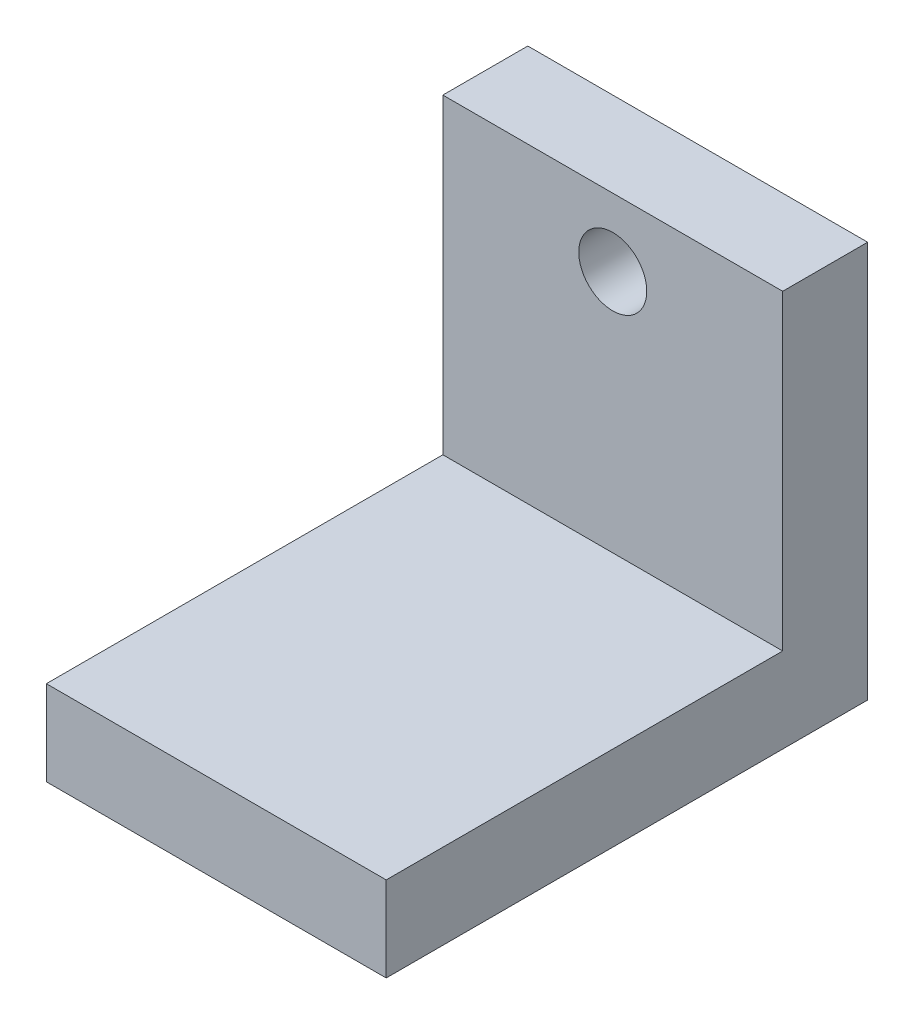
ISO-10303-21;
HEADER;
FILE_DESCRIPTION(('STEP AP214'),'2;1');
FILE_NAME('part.step','',(''),(''),'','','');
FILE_SCHEMA(('AUTOMOTIVE_DESIGN { 1 0 10303 214 1 1 1 1 }'));
ENDSEC;
DATA;
#1=APPLICATION_CONTEXT('core data for automotive mechanical design processes');
#2=APPLICATION_PROTOCOL_DEFINITION('international standard','automotive_design',2000,#1);
#3=PRODUCT_CONTEXT('',#1,'mechanical');
#4=PRODUCT('Part','Part','',(#3));
#5=PRODUCT_RELATED_PRODUCT_CATEGORY('part','',(#4));
#6=PRODUCT_DEFINITION_FORMATION('','',#4);
#7=PRODUCT_DEFINITION_CONTEXT('part definition',#1,'design');
#8=PRODUCT_DEFINITION('design','',#6,#7);
#9=PRODUCT_DEFINITION_SHAPE('','',#8);
#10=(LENGTH_UNIT() NAMED_UNIT(*) SI_UNIT(.MILLI.,.METRE.));
#11=(NAMED_UNIT(*) PLANE_ANGLE_UNIT() SI_UNIT($,.RADIAN.));
#12=(NAMED_UNIT(*) SI_UNIT($,.STERADIAN.) SOLID_ANGLE_UNIT());
#13=UNCERTAINTY_MEASURE_WITH_UNIT(LENGTH_MEASURE(1.E-05),#10,'distance_accuracy_value','');
#14=(GEOMETRIC_REPRESENTATION_CONTEXT(3) GLOBAL_UNCERTAINTY_ASSIGNED_CONTEXT((#13)) GLOBAL_UNIT_ASSIGNED_CONTEXT((#10,
#11,#12)) REPRESENTATION_CONTEXT('',''));
#15=CARTESIAN_POINT('',(0.,0.,0.));
#16=DIRECTION('',(0.,0.,1.));
#17=DIRECTION('',(1.,0.,0.));
#18=AXIS2_PLACEMENT_3D('',#15,#16,#17);
#19=CARTESIAN_POINT('',(30.,-3.75,-25.));
#20=DIRECTION('',(0.,0.,1.));
#21=DIRECTION('',(0.,-1.,0.));
#22=AXIS2_PLACEMENT_3D('',#19,#20,#21);
#23=PLANE('',#22);
#24=CARTESIAN_POINT('',(15.,25.25,-25.));
#25=DIRECTION('',(0.,0.,1.));
#26=DIRECTION('',(1.,0.,0.));
#27=AXIS2_PLACEMENT_3D('',#24,#25,#26);
#28=CIRCLE('',#27,3.);
#29=CARTESIAN_POINT('',(18.,25.25,-25.));
#30=VERTEX_POINT('',#29);
#31=EDGE_CURVE('E153',#30,#30,#28,.T.);
#32=ORIENTED_EDGE('',*,*,#31,.T.);
#33=EDGE_LOOP('',(#32));
#34=FACE_BOUND('',#33,.T.);
#35=DIRECTION('',(0.,1.,0.));
#36=VECTOR('',#35,1.);
#37=CARTESIAN_POINT('',(0.,-3.75,-25.));
#38=LINE('',#37,#36);
#39=CARTESIAN_POINT('',(0.,-3.75,-25.));
#40=VERTEX_POINT('',#39);
#41=CARTESIAN_POINT('',(0.,31.25,-25.));
#42=VERTEX_POINT('',#41);
#43=EDGE_CURVE('E128',#40,#42,#38,.T.);
#44=ORIENTED_EDGE('',*,*,#43,.T.);
#45=DIRECTION('',(-1.,0.,0.));
#46=VECTOR('',#45,1.);
#47=CARTESIAN_POINT('',(30.,31.25,-25.));
#48=LINE('',#47,#46);
#49=CARTESIAN_POINT('',(30.,31.25,-25.));
#50=VERTEX_POINT('',#49);
#51=EDGE_CURVE('E48',#50,#42,#48,.T.);
#52=ORIENTED_EDGE('',*,*,#51,.F.);
#53=DIRECTION('',(0.,1.,0.));
#54=VECTOR('',#53,1.);
#55=CARTESIAN_POINT('',(30.,-3.75,-25.));
#56=LINE('',#55,#54);
#57=CARTESIAN_POINT('',(30.,-3.75,-25.));
#58=VERTEX_POINT('',#57);
#59=EDGE_CURVE('E94',#58,#50,#56,.T.);
#60=ORIENTED_EDGE('',*,*,#59,.F.);
#61=DIRECTION('',(-1.,0.,0.));
#62=VECTOR('',#61,1.);
#63=CARTESIAN_POINT('',(30.,-3.75,-25.));
#64=LINE('',#63,#62);
#65=EDGE_CURVE('E11',#58,#40,#64,.T.);
#66=ORIENTED_EDGE('',*,*,#65,.T.);
#67=EDGE_LOOP('',(#44,#52,#60,#66));
#68=FACE_BOUND('',#67,.T.);
#69=ADVANCED_FACE('F39',(#34,#68),#23,.F.);
#70=CARTESIAN_POINT('',(30.,31.25,-17.5));
#71=DIRECTION('',(0.,-1.,0.));
#72=DIRECTION('',(0.,0.,-1.));
#73=AXIS2_PLACEMENT_3D('',#70,#71,#72);
#74=PLANE('',#73);
#75=DIRECTION('',(0.,0.,1.));
#76=VECTOR('',#75,1.);
#77=CARTESIAN_POINT('',(0.,31.25,-17.5));
#78=LINE('',#77,#76);
#79=CARTESIAN_POINT('',(0.,31.25,-17.5));
#80=VERTEX_POINT('',#79);
#81=EDGE_CURVE('E130',#42,#80,#78,.T.);
#82=ORIENTED_EDGE('',*,*,#81,.T.);
#83=DIRECTION('',(-1.,0.,0.));
#84=VECTOR('',#83,1.);
#85=CARTESIAN_POINT('',(30.,31.25,-17.5));
#86=LINE('',#85,#84);
#87=CARTESIAN_POINT('',(30.,31.25,-17.5));
#88=VERTEX_POINT('',#87);
#89=EDGE_CURVE('E117',#88,#80,#86,.T.);
#90=ORIENTED_EDGE('',*,*,#89,.F.);
#91=DIRECTION('',(0.,0.,1.));
#92=VECTOR('',#91,1.);
#93=CARTESIAN_POINT('',(30.,31.25,-17.5));
#94=LINE('',#93,#92);
#95=EDGE_CURVE('E108',#50,#88,#94,.T.);
#96=ORIENTED_EDGE('',*,*,#95,.F.);
#97=ORIENTED_EDGE('',*,*,#51,.T.);
#98=EDGE_LOOP('',(#82,#90,#96,#97));
#99=FACE_BOUND('',#98,.T.);
#100=ADVANCED_FACE('F143',(#99),#74,.F.);
#101=CARTESIAN_POINT('',(30.,3.75,-17.5));
#102=DIRECTION('',(0.,0.,-1.));
#103=DIRECTION('',(0.,1.,0.));
#104=AXIS2_PLACEMENT_3D('',#101,#102,#103);
#105=PLANE('',#104);
#106=CARTESIAN_POINT('',(15.,25.25,-17.5));
#107=DIRECTION('',(0.,0.,-1.));
#108=DIRECTION('',(0.,1.,0.));
#109=AXIS2_PLACEMENT_3D('',#106,#107,#108);
#110=CIRCLE('',#109,3.);
#111=CARTESIAN_POINT('',(15.,28.25,-17.5));
#112=VERTEX_POINT('',#111);
#113=EDGE_CURVE('E42',#112,#112,#110,.T.);
#114=ORIENTED_EDGE('',*,*,#113,.T.);
#115=EDGE_LOOP('',(#114));
#116=FACE_BOUND('',#115,.T.);
#117=DIRECTION('',(0.,-1.,0.));
#118=VECTOR('',#117,1.);
#119=CARTESIAN_POINT('',(0.,3.75,-17.5));
#120=LINE('',#119,#118);
#121=CARTESIAN_POINT('',(0.,3.75,-17.5));
#122=VERTEX_POINT('',#121);
#123=EDGE_CURVE('E116',#80,#122,#120,.T.);
#124=ORIENTED_EDGE('',*,*,#123,.T.);
#125=DIRECTION('',(-1.,0.,0.));
#126=VECTOR('',#125,1.);
#127=CARTESIAN_POINT('',(30.,3.75,-17.5));
#128=LINE('',#127,#126);
#129=CARTESIAN_POINT('',(30.,3.75,-17.5));
#130=VERTEX_POINT('',#129);
#131=EDGE_CURVE('E113',#130,#122,#128,.T.);
#132=ORIENTED_EDGE('',*,*,#131,.F.);
#133=DIRECTION('',(0.,-1.,0.));
#134=VECTOR('',#133,1.);
#135=CARTESIAN_POINT('',(30.,3.75,-17.5));
#136=LINE('',#135,#134);
#137=EDGE_CURVE('E102',#88,#130,#136,.T.);
#138=ORIENTED_EDGE('',*,*,#137,.F.);
#139=ORIENTED_EDGE('',*,*,#89,.T.);
#140=EDGE_LOOP('',(#124,#132,#138,#139));
#141=FACE_BOUND('',#140,.T.);
#142=ADVANCED_FACE('F114',(#116,#141),#105,.F.);
#143=CARTESIAN_POINT('',(30.,3.75,17.5));
#144=DIRECTION('',(0.,-1.,0.));
#145=DIRECTION('',(0.,0.,-1.));
#146=AXIS2_PLACEMENT_3D('',#143,#144,#145);
#147=PLANE('',#146);
#148=DIRECTION('',(0.,0.,1.));
#149=VECTOR('',#148,1.);
#150=CARTESIAN_POINT('',(0.,3.75,17.5));
#151=LINE('',#150,#149);
#152=CARTESIAN_POINT('',(0.,3.75,17.5));
#153=VERTEX_POINT('',#152);
#154=EDGE_CURVE('E80',#122,#153,#151,.T.);
#155=ORIENTED_EDGE('',*,*,#154,.T.);
#156=DIRECTION('',(-1.,0.,0.));
#157=VECTOR('',#156,1.);
#158=CARTESIAN_POINT('',(30.,3.75,17.5));
#159=LINE('',#158,#157);
#160=CARTESIAN_POINT('',(30.,3.75,17.5));
#161=VERTEX_POINT('',#160);
#162=EDGE_CURVE('E118',#161,#153,#159,.T.);
#163=ORIENTED_EDGE('',*,*,#162,.F.);
#164=DIRECTION('',(0.,0.,1.));
#165=VECTOR('',#164,1.);
#166=CARTESIAN_POINT('',(30.,3.75,17.5));
#167=LINE('',#166,#165);
#168=EDGE_CURVE('E106',#130,#161,#167,.T.);
#169=ORIENTED_EDGE('',*,*,#168,.F.);
#170=ORIENTED_EDGE('',*,*,#131,.T.);
#171=EDGE_LOOP('',(#155,#163,#169,#170));
#172=FACE_BOUND('',#171,.T.);
#173=ADVANCED_FACE('F120',(#172),#147,.F.);
#174=CARTESIAN_POINT('',(30.,3.75,17.5));
#175=DIRECTION('',(0.,0.,-1.));
#176=DIRECTION('',(-1.,0.,0.));
#177=AXIS2_PLACEMENT_3D('',#174,#175,#176);
#178=PLANE('',#177);
#179=DIRECTION('',(0.,-1.,0.));
#180=VECTOR('',#179,1.);
#181=CARTESIAN_POINT('',(0.,3.75,17.5));
#182=LINE('',#181,#180);
#183=CARTESIAN_POINT('',(0.,-3.75,17.5));
#184=VERTEX_POINT('',#183);
#185=EDGE_CURVE('E87',#153,#184,#182,.T.);
#186=ORIENTED_EDGE('',*,*,#185,.T.);
#187=DIRECTION('',(-1.,0.,0.));
#188=VECTOR('',#187,1.);
#189=CARTESIAN_POINT('',(30.,-3.75,17.5));
#190=LINE('',#189,#188);
#191=CARTESIAN_POINT('',(30.,-3.75,17.5));
#192=VERTEX_POINT('',#191);
#193=EDGE_CURVE('E124',#192,#184,#190,.T.);
#194=ORIENTED_EDGE('',*,*,#193,.F.);
#195=DIRECTION('',(0.,-1.,0.));
#196=VECTOR('',#195,1.);
#197=CARTESIAN_POINT('',(30.,3.75,17.5));
#198=LINE('',#197,#196);
#199=EDGE_CURVE('E122',#161,#192,#198,.T.);
#200=ORIENTED_EDGE('',*,*,#199,.F.);
#201=ORIENTED_EDGE('',*,*,#162,.T.);
#202=EDGE_LOOP('',(#186,#194,#200,#201));
#203=FACE_BOUND('',#202,.T.);
#204=ADVANCED_FACE('F149',(#203),#178,.F.);
#205=CARTESIAN_POINT('',(30.,-3.75,17.5));
#206=DIRECTION('',(0.,1.,0.));
#207=DIRECTION('',(0.,0.,1.));
#208=AXIS2_PLACEMENT_3D('',#205,#206,#207);
#209=PLANE('',#208);
#210=DIRECTION('',(0.,0.,-1.));
#211=VECTOR('',#210,1.);
#212=CARTESIAN_POINT('',(0.,-3.75,17.5));
#213=LINE('',#212,#211);
#214=EDGE_CURVE('E135',#184,#40,#213,.T.);
#215=ORIENTED_EDGE('',*,*,#214,.T.);
#216=ORIENTED_EDGE('',*,*,#65,.F.);
#217=DIRECTION('',(0.,0.,-1.));
#218=VECTOR('',#217,1.);
#219=CARTESIAN_POINT('',(30.,-3.75,-17.5));
#220=LINE('',#219,#218);
#221=EDGE_CURVE('E56',#192,#58,#220,.T.);
#222=ORIENTED_EDGE('',*,*,#221,.F.);
#223=ORIENTED_EDGE('',*,*,#193,.T.);
#224=EDGE_LOOP('',(#215,#216,#222,#223));
#225=FACE_BOUND('',#224,.T.);
#226=ADVANCED_FACE('F148',(#225),#209,.F.);
#227=CARTESIAN_POINT('',(30.,0.,0.));
#228=DIRECTION('',(1.,0.,0.));
#229=DIRECTION('',(0.,0.,-1.));
#230=AXIS2_PLACEMENT_3D('',#227,#228,#229);
#231=PLANE('',#230);
#232=ORIENTED_EDGE('',*,*,#221,.T.);
#233=ORIENTED_EDGE('',*,*,#59,.T.);
#234=ORIENTED_EDGE('',*,*,#95,.T.);
#235=ORIENTED_EDGE('',*,*,#137,.T.);
#236=ORIENTED_EDGE('',*,*,#168,.T.);
#237=ORIENTED_EDGE('',*,*,#199,.T.);
#238=EDGE_LOOP('',(#232,#233,#234,#235,#236,#237));
#239=FACE_BOUND('',#238,.T.);
#240=ADVANCED_FACE('F104',(#239),#231,.T.);
#241=CARTESIAN_POINT('',(0.,0.,0.));
#242=DIRECTION('',(1.,0.,0.));
#243=DIRECTION('',(0.,0.,-1.));
#244=AXIS2_PLACEMENT_3D('',#241,#242,#243);
#245=PLANE('',#244);
#246=ORIENTED_EDGE('',*,*,#43,.F.);
#247=ORIENTED_EDGE('',*,*,#214,.F.);
#248=ORIENTED_EDGE('',*,*,#185,.F.);
#249=ORIENTED_EDGE('',*,*,#154,.F.);
#250=ORIENTED_EDGE('',*,*,#123,.F.);
#251=ORIENTED_EDGE('',*,*,#81,.F.);
#252=EDGE_LOOP('',(#246,#247,#248,#249,#250,#251));
#253=FACE_BOUND('',#252,.T.);
#254=ADVANCED_FACE('F146',(#253),#245,.F.);
#255=CARTESIAN_POINT('',(15.,25.25,-25.));
#256=DIRECTION('',(0.,0.,1.));
#257=DIRECTION('',(1.,0.,0.));
#258=AXIS2_PLACEMENT_3D('',#255,#256,#257);
#259=CYLINDRICAL_SURFACE('',#258,3.);
#260=ORIENTED_EDGE('',*,*,#31,.F.);
#261=EDGE_LOOP('',(#260));
#262=FACE_BOUND('',#261,.T.);
#263=ORIENTED_EDGE('',*,*,#113,.F.);
#264=EDGE_LOOP('',(#263));
#265=FACE_BOUND('',#264,.T.);
#266=ADVANCED_FACE('F161',(#262,#265),#259,.F.);
#267=CLOSED_SHELL('',(#69,#100,#142,#173,#204,#226,#240,#254,#266));
#268=MANIFOLD_SOLID_BREP('B2',#267);
#269=ADVANCED_BREP_SHAPE_REPRESENTATION('',(#18,#268),#14);
#270=SHAPE_DEFINITION_REPRESENTATION(#9,#269);
ENDSEC;
END-ISO-10303-21;
